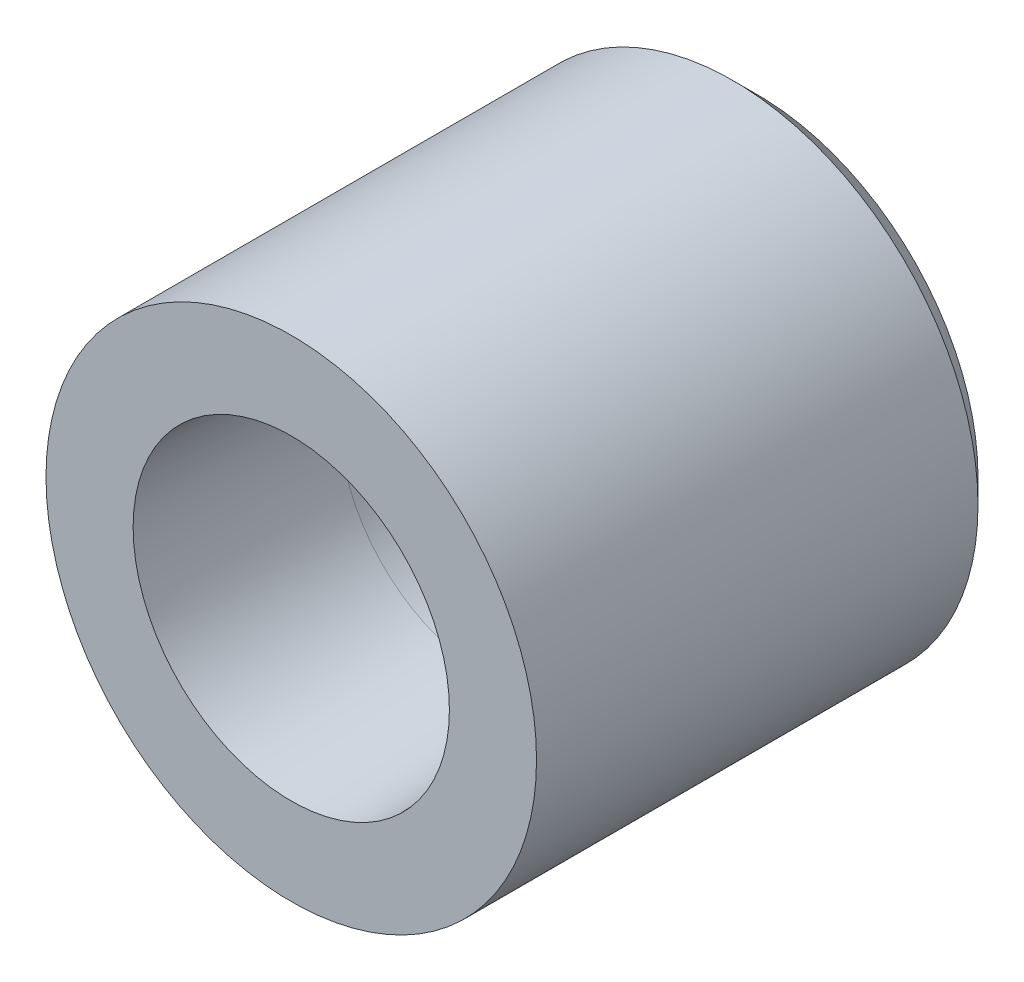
ISO-10303-21;
HEADER;
FILE_DESCRIPTION(('STEP AP214'),'2;1');
FILE_NAME('part.step','',(''),(''),'','','');
FILE_SCHEMA(('AUTOMOTIVE_DESIGN { 1 0 10303 214 1 1 1 1 }'));
ENDSEC;
DATA;
#1=APPLICATION_CONTEXT('core data for automotive mechanical design processes');
#2=APPLICATION_PROTOCOL_DEFINITION('international standard','automotive_design',2000,#1);
#3=PRODUCT_CONTEXT('',#1,'mechanical');
#4=PRODUCT('Part','Part','',(#3));
#5=PRODUCT_RELATED_PRODUCT_CATEGORY('part','',(#4));
#6=PRODUCT_DEFINITION_FORMATION('','',#4);
#7=PRODUCT_DEFINITION_CONTEXT('part definition',#1,'design');
#8=PRODUCT_DEFINITION('design','',#6,#7);
#9=PRODUCT_DEFINITION_SHAPE('','',#8);
#10=(LENGTH_UNIT() NAMED_UNIT(*) SI_UNIT(.MILLI.,.METRE.));
#11=(NAMED_UNIT(*) PLANE_ANGLE_UNIT() SI_UNIT($,.RADIAN.));
#12=(NAMED_UNIT(*) SI_UNIT($,.STERADIAN.) SOLID_ANGLE_UNIT());
#13=UNCERTAINTY_MEASURE_WITH_UNIT(LENGTH_MEASURE(1.E-05),#10,'distance_accuracy_value','');
#14=(GEOMETRIC_REPRESENTATION_CONTEXT(3) GLOBAL_UNCERTAINTY_ASSIGNED_CONTEXT((#13)) GLOBAL_UNIT_ASSIGNED_CONTEXT((#10,
#11,#12)) REPRESENTATION_CONTEXT('',''));
#15=CARTESIAN_POINT('',(0.,0.,0.));
#16=DIRECTION('',(0.,0.,1.));
#17=DIRECTION('',(1.,0.,0.));
#18=AXIS2_PLACEMENT_3D('',#15,#16,#17);
#19=CARTESIAN_POINT('',(0.,0.,-8.50298396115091));
#20=DIRECTION('',(0.,0.,1.));
#21=DIRECTION('',(1.,0.,0.));
#22=AXIS2_PLACEMENT_3D('',#19,#20,#21);
#23=CONICAL_SURFACE('',#22,8.52534602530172,0.785398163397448);
#24=CARTESIAN_POINT('',(0.,0.,-12.));
#25=DIRECTION('',(0.,0.,1.));
#26=DIRECTION('',(-1.,0.,0.));
#27=AXIS2_PLACEMENT_3D('',#24,#25,#26);
#28=CIRCLE('',#27,5.02832998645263);
#29=CARTESIAN_POINT('',(5.02832998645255,0.,-12.));
#30=VERTEX_POINT('',#29);
#31=CARTESIAN_POINT('',(-5.02832998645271,0.,-12.));
#32=VERTEX_POINT('',#31);
#33=EDGE_CURVE('E143',#30,#32,#28,.T.);
#34=ORIENTED_EDGE('',*,*,#33,.F.);
#35=CARTESIAN_POINT('',(5.02833262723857,0.,-11.999997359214));
#36=CARTESIAN_POINT('',(6.0283325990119,0.,-10.9999973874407));
#37=B_SPLINE_CURVE_WITH_KNOTS('',1,(#35,#36),.UNSPECIFIED.,.F.,.F.,(2,2),(0.58980979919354,
0.707107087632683),.UNSPECIFIED.);
#38=CARTESIAN_POINT('',(6.02832998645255,0.,-11.));
#39=VERTEX_POINT('',#38);
#40=EDGE_CURVE('E44',#30,#39,#37,.T.);
#41=ORIENTED_EDGE('',*,*,#40,.T.);
#42=CARTESIAN_POINT('',(0.,0.,-11.));
#43=DIRECTION('',(0.,0.,-1.));
#44=DIRECTION('',(-1.,0.,0.));
#45=AXIS2_PLACEMENT_3D('',#42,#43,#44);
#46=CIRCLE('',#45,6.02832998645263);
#47=CARTESIAN_POINT('',(-6.02832998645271,0.,-11.));
#48=VERTEX_POINT('',#47);
#49=EDGE_CURVE('E11',#48,#39,#46,.T.);
#50=ORIENTED_EDGE('',*,*,#49,.F.);
#51=CARTESIAN_POINT('',(0.,0.,-11.));
#52=DIRECTION('',(0.,0.,-1.));
#53=DIRECTION('',(-1.,0.,0.));
#54=AXIS2_PLACEMENT_3D('',#51,#52,#53);
#55=CIRCLE('',#54,6.02832998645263);
#56=EDGE_CURVE('E51',#39,#48,#55,.T.);
#57=ORIENTED_EDGE('',*,*,#56,.F.);
#58=ORIENTED_EDGE('',*,*,#40,.F.);
#59=CARTESIAN_POINT('',(0.,0.,-12.));
#60=DIRECTION('',(0.,0.,1.));
#61=DIRECTION('',(-1.,0.,0.));
#62=AXIS2_PLACEMENT_3D('',#59,#60,#61);
#63=CIRCLE('',#62,5.02832998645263);
#64=EDGE_CURVE('E59',#32,#30,#63,.T.);
#65=ORIENTED_EDGE('',*,*,#64,.F.);
#66=EDGE_LOOP('',(#34,#41,#50,#57,#58,#65));
#67=FACE_BOUND('',#66,.T.);
#68=ADVANCED_FACE('F36',(#67),#23,.F.);
#69=CARTESIAN_POINT('',(0.,0.,-10.5));
#70=DIRECTION('',(0.,0.,-1.));
#71=DIRECTION('',(-1.,0.,0.));
#72=AXIS2_PLACEMENT_3D('',#69,#70,#71);
#73=CYLINDRICAL_SURFACE('',#72,6.02832998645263);
#74=CARTESIAN_POINT('',(0.,0.,-9.));
#75=DIRECTION('',(0.,0.,-1.));
#76=DIRECTION('',(-1.,0.,0.));
#77=AXIS2_PLACEMENT_3D('',#74,#75,#76);
#78=CIRCLE('',#77,6.02832998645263);
#79=CARTESIAN_POINT('',(-6.02832998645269,0.,-9.));
#80=VERTEX_POINT('',#79);
#81=EDGE_CURVE('E152',#80,#80,#78,.T.);
#82=ORIENTED_EDGE('',*,*,#81,.F.);
#83=CARTESIAN_POINT('',(-6.02832998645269,0.,-8.99999694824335));
#84=CARTESIAN_POINT('',(-6.02832998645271,0.,-11.000002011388));
#85=B_SPLINE_CURVE_WITH_KNOTS('',1,(#83,#84),.UNSPECIFIED.,.F.,.F.,(2,2),(0.0833320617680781,
0.91666750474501),.UNSPECIFIED.);
#86=EDGE_CURVE('E147',#80,#48,#85,.T.);
#87=ORIENTED_EDGE('',*,*,#86,.T.);
#88=ORIENTED_EDGE('',*,*,#49,.T.);
#89=ORIENTED_EDGE('',*,*,#56,.T.);
#90=ORIENTED_EDGE('',*,*,#86,.F.);
#91=EDGE_LOOP('',(#82,#87,#88,#89,#90));
#92=FACE_BOUND('',#91,.T.);
#93=ADVANCED_FACE('F191',(#92),#73,.F.);
#94=CARTESIAN_POINT('',(11.565158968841,-10.4511876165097,-12.));
#95=DIRECTION('',(0.,0.,-1.));
#96=DIRECTION('',(-1.,0.,0.));
#97=AXIS2_PLACEMENT_3D('',#94,#95,#96);
#98=PLANE('',#97);
#99=CARTESIAN_POINT('',(-1.39645239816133E-13,0.,-11.9999999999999));
#100=DIRECTION('',(0.,0.,-1.));
#101=DIRECTION('',(-1.,0.,0.));
#102=AXIS2_PLACEMENT_3D('',#99,#100,#101);
#103=CIRCLE('',#102,2.49999999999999);
#104=CARTESIAN_POINT('',(-2.50000000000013,0.,-11.9999999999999));
#105=VERTEX_POINT('',#104);
#106=EDGE_CURVE('E103',#105,#105,#103,.T.);
#107=ORIENTED_EDGE('',*,*,#106,.T.);
#108=EDGE_LOOP('',(#107));
#109=FACE_BOUND('',#108,.T.);
#110=ORIENTED_EDGE('',*,*,#64,.T.);
#111=ORIENTED_EDGE('',*,*,#33,.T.);
#112=EDGE_LOOP('',(#110,#111));
#113=FACE_BOUND('',#112,.T.);
#114=ADVANCED_FACE('F193',(#109,#113),#98,.F.);
#115=CARTESIAN_POINT('',(0.,0.,-1.));
#116=DIRECTION('',(0.,0.,1.));
#117=DIRECTION('',(-1.,0.,0.));
#118=AXIS2_PLACEMENT_3D('',#115,#116,#117);
#119=CONICAL_SURFACE('',#118,6.44759222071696,0.0523598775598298);
#120=ORIENTED_EDGE('',*,*,#81,.T.);
#121=CARTESIAN_POINT('',(-6.02832998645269,0.,-9.));
#122=CARTESIAN_POINT('',(-6.44759222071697,0.,-0.999999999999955));
#123=B_SPLINE_CURVE_WITH_KNOTS('',1,(#121,#122),.UNSPECIFIED.,.F.,.F.,(2,2),(0.,1.),.UNSPECIFIED.);
#124=CARTESIAN_POINT('',(-6.44759222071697,0.,-0.999999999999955));
#125=VERTEX_POINT('',#124);
#126=EDGE_CURVE('E108',#80,#125,#123,.T.);
#127=ORIENTED_EDGE('',*,*,#126,.T.);
#128=CARTESIAN_POINT('',(0.,0.,-1.));
#129=DIRECTION('',(0.,0.,-1.));
#130=DIRECTION('',(1.,0.,0.));
#131=AXIS2_PLACEMENT_3D('',#128,#129,#130);
#132=CIRCLE('',#131,6.44759222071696);
#133=CARTESIAN_POINT('',(6.44759222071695,0.,-1.00000000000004));
#134=VERTEX_POINT('',#133);
#135=EDGE_CURVE('E133',#134,#125,#132,.T.);
#136=ORIENTED_EDGE('',*,*,#135,.F.);
#137=CARTESIAN_POINT('',(0.,0.,-1.));
#138=DIRECTION('',(0.,0.,-1.));
#139=DIRECTION('',(1.,0.,0.));
#140=AXIS2_PLACEMENT_3D('',#137,#138,#139);
#141=CIRCLE('',#140,6.44759222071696);
#142=EDGE_CURVE('E126',#125,#134,#141,.T.);
#143=ORIENTED_EDGE('',*,*,#142,.F.);
#144=ORIENTED_EDGE('',*,*,#126,.F.);
#145=EDGE_LOOP('',(#120,#127,#136,#143,#144));
#146=FACE_BOUND('',#145,.T.);
#147=ADVANCED_FACE('F189',(#146),#119,.F.);
#148=CARTESIAN_POINT('',(-1.03751912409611E-13,0.,-14.857864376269));
#149=DIRECTION('',(0.,0.,1.));
#150=DIRECTION('',(1.,0.,0.));
#151=AXIS2_PLACEMENT_3D('',#148,#149,#150);
#152=CONICAL_SURFACE('',#151,14.1421356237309,0.785398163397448);
#153=CARTESIAN_POINT('',(-1.39659253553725E-13,0.,-20.));
#154=DIRECTION('',(0.,0.,1.));
#155=DIRECTION('',(-1.,0.,0.));
#156=AXIS2_PLACEMENT_3D('',#153,#154,#155);
#157=CIRCLE('',#156,9.);
#158=CARTESIAN_POINT('',(-9.00000000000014,0.,-20.));
#159=VERTEX_POINT('',#158);
#160=CARTESIAN_POINT('',(8.99999999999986,0.,-20.));
#161=VERTEX_POINT('',#160);
#162=EDGE_CURVE('E90',#159,#161,#157,.T.);
#163=ORIENTED_EDGE('',*,*,#162,.T.);
#164=CARTESIAN_POINT('',(9.00000161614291,0.,-19.999998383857));
#165=CARTESIAN_POINT('',(10.0000008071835,0.,-18.9999991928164));
#166=B_SPLINE_CURVE_WITH_KNOTS('',1,(#164,#165),.UNSPECIFIED.,.F.,.F.,(2,2),(0.636396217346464,
0.707106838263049),.UNSPECIFIED.);
#167=CARTESIAN_POINT('',(9.99999999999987,0.,-19.));
#168=VERTEX_POINT('',#167);
#169=EDGE_CURVE('E95',#161,#168,#166,.T.);
#170=ORIENTED_EDGE('',*,*,#169,.T.);
#171=CARTESIAN_POINT('',(-1.32676290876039E-13,0.,-19.));
#172=DIRECTION('',(0.,0.,-1.));
#173=DIRECTION('',(-1.,0.,0.));
#174=AXIS2_PLACEMENT_3D('',#171,#172,#173);
#175=CIRCLE('',#174,10.);
#176=CARTESIAN_POINT('',(-10.0000000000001,0.,-19.));
#177=VERTEX_POINT('',#176);
#178=EDGE_CURVE('E102',#168,#177,#175,.T.);
#179=ORIENTED_EDGE('',*,*,#178,.T.);
#180=CARTESIAN_POINT('',(-1.32676290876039E-13,0.,-19.));
#181=DIRECTION('',(0.,0.,-1.));
#182=DIRECTION('',(-1.,0.,0.));
#183=AXIS2_PLACEMENT_3D('',#180,#181,#182);
#184=CIRCLE('',#183,10.);
#185=EDGE_CURVE('E105',#177,#168,#184,.T.);
#186=ORIENTED_EDGE('',*,*,#185,.T.);
#187=ORIENTED_EDGE('',*,*,#169,.F.);
#188=CARTESIAN_POINT('',(-1.39659253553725E-13,0.,-20.));
#189=DIRECTION('',(0.,0.,1.));
#190=DIRECTION('',(-1.,0.,0.));
#191=AXIS2_PLACEMENT_3D('',#188,#189,#190);
#192=CIRCLE('',#191,9.);
#193=EDGE_CURVE('E97',#161,#159,#192,.T.);
#194=ORIENTED_EDGE('',*,*,#193,.T.);
#195=EDGE_LOOP('',(#163,#170,#179,#186,#187,#194));
#196=FACE_BOUND('',#195,.T.);
#197=ADVANCED_FACE('F92',(#196),#152,.T.);
#198=CARTESIAN_POINT('',(0.,0.,-10.5));
#199=DIRECTION('',(0.,0.,-1.));
#200=DIRECTION('',(-1.,0.,0.));
#201=AXIS2_PLACEMENT_3D('',#198,#199,#200);
#202=CYLINDRICAL_SURFACE('',#201,10.);
#203=CARTESIAN_POINT('',(0.,0.,-1.));
#204=DIRECTION('',(0.,0.,1.));
#205=DIRECTION('',(-1.,0.,0.));
#206=AXIS2_PLACEMENT_3D('',#203,#204,#205);
#207=CIRCLE('',#206,10.);
#208=CARTESIAN_POINT('',(-10.,0.,-0.99999999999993));
#209=VERTEX_POINT('',#208);
#210=EDGE_CURVE('E99',#209,#209,#207,.T.);
#211=ORIENTED_EDGE('',*,*,#210,.F.);
#212=CARTESIAN_POINT('',(-10.,0.,-1.00000137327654));
#213=CARTESIAN_POINT('',(-10.0000000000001,0.,-19.0000018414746));
#214=B_SPLINE_CURVE_WITH_KNOTS('',1,(#212,#213),.UNSPECIFIED.,.F.,.F.,(2,2),(0.0833333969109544,
0.916666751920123),.UNSPECIFIED.);
#215=EDGE_CURVE('E173',#209,#177,#214,.T.);
#216=ORIENTED_EDGE('',*,*,#215,.T.);
#217=ORIENTED_EDGE('',*,*,#178,.F.);
#218=ORIENTED_EDGE('',*,*,#185,.F.);
#219=ORIENTED_EDGE('',*,*,#215,.F.);
#220=EDGE_LOOP('',(#211,#216,#217,#218,#219));
#221=FACE_BOUND('',#220,.T.);
#222=ADVANCED_FACE('F225',(#221),#202,.T.);
#223=CARTESIAN_POINT('',(20.7,-18.7061487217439,-20.));
#224=DIRECTION('',(0.,0.,-1.));
#225=DIRECTION('',(-1.,0.,0.));
#226=AXIS2_PLACEMENT_3D('',#223,#224,#225);
#227=PLANE('',#226);
#228=CARTESIAN_POINT('',(-1.39645239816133E-13,0.,-19.9999999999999));
#229=DIRECTION('',(0.,0.,-1.));
#230=DIRECTION('',(-1.,0.,0.));
#231=AXIS2_PLACEMENT_3D('',#228,#229,#230);
#232=CIRCLE('',#231,2.49999999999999);
#233=CARTESIAN_POINT('',(-2.50000000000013,0.,-19.9999999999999));
#234=VERTEX_POINT('',#233);
#235=EDGE_CURVE('E275',#234,#234,#232,.T.);
#236=ORIENTED_EDGE('',*,*,#235,.F.);
#237=EDGE_LOOP('',(#236));
#238=FACE_BOUND('',#237,.T.);
#239=ORIENTED_EDGE('',*,*,#193,.F.);
#240=ORIENTED_EDGE('',*,*,#162,.F.);
#241=EDGE_LOOP('',(#239,#240));
#242=FACE_BOUND('',#241,.T.);
#243=ADVANCED_FACE('F101',(#238,#242),#227,.T.);
#244=CARTESIAN_POINT('',(-13.,-20.7846096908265,-0.999999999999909));
#245=DIRECTION('',(0.,0.,1.));
#246=DIRECTION('',(1.,0.,0.));
#247=AXIS2_PLACEMENT_3D('',#244,#245,#246);
#248=PLANE('',#247);
#249=ORIENTED_EDGE('',*,*,#210,.T.);
#250=EDGE_LOOP('',(#249));
#251=FACE_BOUND('',#250,.T.);
#252=ORIENTED_EDGE('',*,*,#135,.T.);
#253=ORIENTED_EDGE('',*,*,#142,.T.);
#254=EDGE_LOOP('',(#252,#253));
#255=FACE_BOUND('',#254,.T.);
#256=ADVANCED_FACE('F240',(#251,#255),#248,.T.);
#257=CARTESIAN_POINT('',(-1.39645239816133E-13,0.,-19.9999999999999));
#258=DIRECTION('',(0.,0.,-1.));
#259=DIRECTION('',(-1.,0.,0.));
#260=AXIS2_PLACEMENT_3D('',#257,#258,#259);
#261=CYLINDRICAL_SURFACE('',#260,2.49999999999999);
#262=ORIENTED_EDGE('',*,*,#235,.T.);
#263=EDGE_LOOP('',(#262));
#264=FACE_BOUND('',#263,.T.);
#265=ORIENTED_EDGE('',*,*,#106,.F.);
#266=EDGE_LOOP('',(#265));
#267=FACE_BOUND('',#266,.T.);
#268=ADVANCED_FACE('F248',(#264,#267),#261,.F.);
#269=CLOSED_SHELL('',(#68,#93,#114,#147,#197,#222,#243,#256,#268));
#270=MANIFOLD_SOLID_BREP('B2',#269);
#271=ADVANCED_BREP_SHAPE_REPRESENTATION('',(#18,#270),#14);
#272=SHAPE_DEFINITION_REPRESENTATION(#9,#271);
ENDSEC;
END-ISO-10303-21;
